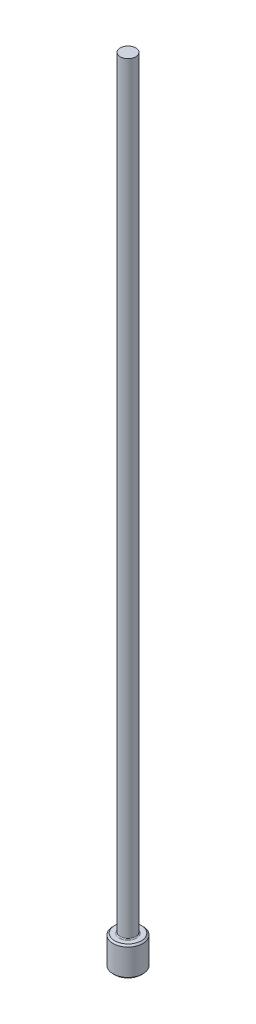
from build123d import *

# Parameters (mm, degrees)
CHAMFER1_SIZE = 0.127
FILLET1_R     = 0.0762


with BuildPart() as part:
    # Sketch1 → Revolve1 (revolve)
    with BuildSketch(Plane.XY, mode=Mode.PRIVATE) as revolve1_sk:
        Polygon((0, 0), (-1.1938, 0), (-1.1938, 2.3622), (-0.6223, 2.3622), (-0.6223, 63.5), (0, 63.5), align=None)
    revolve(revolve1_sk.sketch.rotate(Axis((0, 259.958771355, 0), (0, -1, 0)), 270), axis=Axis((0, 259.958771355, 0), (0, -1, 0)))

    # Chamfer1
    chamfer1_edges = [part.edges().sort_by_distance(p)[0] for p in [
        (0, 2.3622, -1.1938),
        (0, 0, -1.1938),
    ]]
    chamfer(chamfer1_edges, length=CHAMFER1_SIZE)

    # Fillet1
    fillet1_edges = [part.edges().sort_by_distance(p)[0] for p in [
        (0, 2.3622, -0.6223),
    ]]
    fillet(fillet1_edges, radius=FILLET1_R)


solid = part.part
